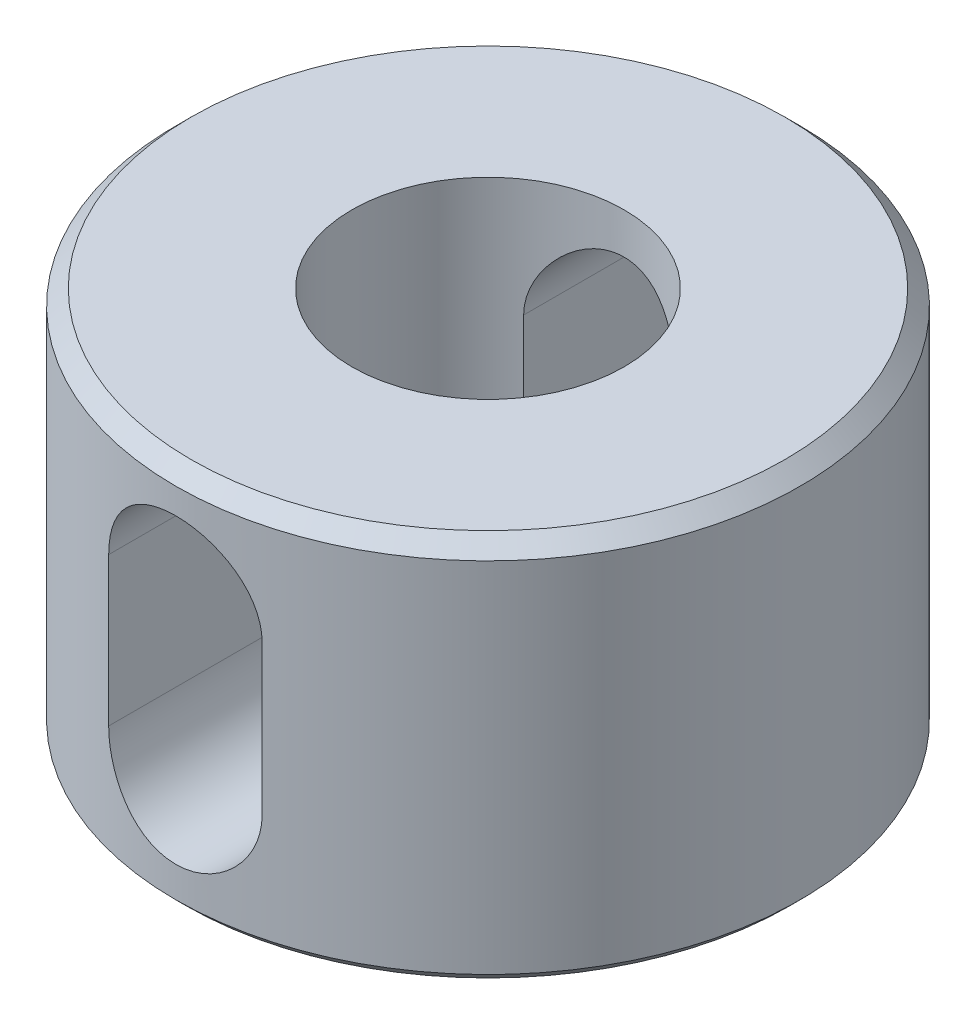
from build123d import *

# Parameters (mm, degrees)
SKETCH1_R         = 7.747
ROD_DEPTH         = 9.525
SKETCH5_R         = 3.3782
TOP_CBORE_DEPTH   = 8.89
CHAMFER1_SIZE     = 0.254
CHAMFER2_SIZE     = 0.381
SKETCH10_R        = 1.5875
BOTTOM_VENT_DEPTH = 15.517494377
SLOT_DEPTH        = 15.517494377
SLOT_DEPTH_BACK   = 15.517494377


with BuildPart() as part:
    # Sketch1 → rod (new body)
    with BuildSketch(Plane(origin=(0, 0, 0), x_dir=(1, 0, 0), z_dir=(0, 1, 0))):
        with Locations(Location((0, 0, 0), (0, 0, 90))):
            Circle(SKETCH1_R)
    extrude(amount=ROD_DEPTH)

    # Sketch5 → top cbore (cut)
    with BuildSketch(Plane(origin=(0, 9.525, 0), x_dir=(1, 0, 0), z_dir=(0, 1, 0))):
        with Locations(Location((0, 0, 0), (0, 0, 270))):
            Circle(SKETCH5_R)
    extrude(amount=-TOP_CBORE_DEPTH, mode=Mode.SUBTRACT)

    # Chamfer1
    chamfer1_edges = [part.edges().sort_by_distance(p)[0] for p in [
        (0, 0, 7.747),
    ]]
    chamfer(chamfer1_edges, length=CHAMFER1_SIZE)

    # Chamfer2
    chamfer2_edges = [part.edges().sort_by_distance(p)[0] for p in [
        (0, 9.525, 7.747),
    ]]
    chamfer(chamfer2_edges, length=CHAMFER2_SIZE)

    # Sketch10 → bottom vent (cut, through all)
    with BuildSketch(Plane.XZ):
        with Locations(Location((0, 0, 0), (0, 0, 270))):
            Circle(SKETCH10_R)
    extrude(amount=-BOTTOM_VENT_DEPTH, mode=Mode.SUBTRACT)

    # Sketch11 → slot (cut, two sides: drawn at the far end of the back side and taken through both)
    with BuildSketch(Plane.XY.offset(-SLOT_DEPTH_BACK)):
        with BuildLine():
            Line((-1.905, 2.921), (-1.905, 6.604))
            ThreePointArc((-1.905, 6.604), (0, 8.509), (1.905, 6.604))
            Line((1.905, 6.604), (1.905, 2.921))
            ThreePointArc((1.905, 2.921), (0, 1.016), (-1.905, 2.921))
        make_face()
    extrude(amount=SLOT_DEPTH + SLOT_DEPTH_BACK, mode=Mode.SUBTRACT)


solid = part.part
